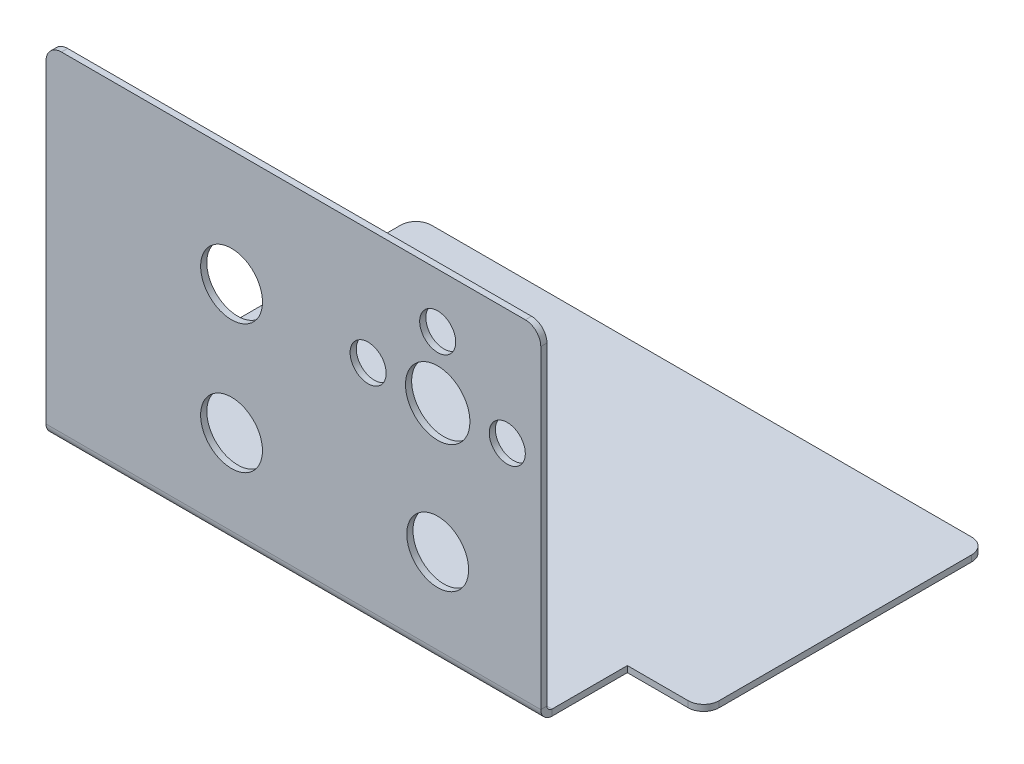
ISO-10303-21;
HEADER;
FILE_DESCRIPTION(('STEP AP214'),'2;1');
FILE_NAME('part.step','',(''),(''),'','','');
FILE_SCHEMA(('AUTOMOTIVE_DESIGN { 1 0 10303 214 1 1 1 1 }'));
ENDSEC;
DATA;
#1=APPLICATION_CONTEXT('core data for automotive mechanical design processes');
#2=APPLICATION_PROTOCOL_DEFINITION('international standard','automotive_design',2000,#1);
#3=PRODUCT_CONTEXT('',#1,'mechanical');
#4=PRODUCT('Part','Part','',(#3));
#5=PRODUCT_RELATED_PRODUCT_CATEGORY('part','',(#4));
#6=PRODUCT_DEFINITION_FORMATION('','',#4);
#7=PRODUCT_DEFINITION_CONTEXT('part definition',#1,'design');
#8=PRODUCT_DEFINITION('design','',#6,#7);
#9=PRODUCT_DEFINITION_SHAPE('','',#8);
#10=(LENGTH_UNIT() NAMED_UNIT(*) SI_UNIT(.MILLI.,.METRE.));
#11=(NAMED_UNIT(*) PLANE_ANGLE_UNIT() SI_UNIT($,.RADIAN.));
#12=(NAMED_UNIT(*) SI_UNIT($,.STERADIAN.) SOLID_ANGLE_UNIT());
#13=UNCERTAINTY_MEASURE_WITH_UNIT(LENGTH_MEASURE(1.E-05),#10,'distance_accuracy_value','');
#14=(GEOMETRIC_REPRESENTATION_CONTEXT(3) GLOBAL_UNCERTAINTY_ASSIGNED_CONTEXT((#13)) GLOBAL_UNIT_ASSIGNED_CONTEXT((#10,
#11,#12)) REPRESENTATION_CONTEXT('',''));
#15=CARTESIAN_POINT('',(0.,0.,0.));
#16=DIRECTION('',(0.,0.,1.));
#17=DIRECTION('',(1.,0.,0.));
#18=AXIS2_PLACEMENT_3D('',#15,#16,#17);
#19=CARTESIAN_POINT('',(0.,0.,1.2));
#20=DIRECTION('',(1.,0.,0.));
#21=DIRECTION('',(0.,0.,1.));
#22=AXIS2_PLACEMENT_3D('',#19,#20,#21);
#23=PLANE('',#22);
#24=DIRECTION('',(0.,1.,0.));
#25=VECTOR('',#24,1.);
#26=CARTESIAN_POINT('',(0.,0.,1.2));
#27=LINE('',#26,#25);
#28=CARTESIAN_POINT('',(0.,0.999999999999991,1.19999999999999));
#29=VERTEX_POINT('',#28);
#30=CARTESIAN_POINT('',(0.,62.,1.2));
#31=VERTEX_POINT('',#30);
#32=EDGE_CURVE('E231',#29,#31,#27,.T.);
#33=ORIENTED_EDGE('',*,*,#32,.F.);
#34=DIRECTION('',(0.,0.,1.));
#35=VECTOR('',#34,1.);
#36=CARTESIAN_POINT('',(0.,0.999999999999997,0.));
#37=LINE('',#36,#35);
#38=CARTESIAN_POINT('',(0.,0.999999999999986,0.));
#39=VERTEX_POINT('',#38);
#40=EDGE_CURVE('E196',#39,#29,#37,.T.);
#41=ORIENTED_EDGE('',*,*,#40,.F.);
#42=DIRECTION('',(0.,1.,0.));
#43=VECTOR('',#42,1.);
#44=CARTESIAN_POINT('',(0.,0.,0.));
#45=LINE('',#44,#43);
#46=CARTESIAN_POINT('',(0.,62.,0.));
#47=VERTEX_POINT('',#46);
#48=EDGE_CURVE('E228',#39,#47,#45,.T.);
#49=ORIENTED_EDGE('',*,*,#48,.T.);
#50=DIRECTION('',(0.,0.,-1.));
#51=VECTOR('',#50,1.);
#52=CARTESIAN_POINT('',(0.,62.,1.2));
#53=LINE('',#52,#51);
#54=EDGE_CURVE('E265',#31,#47,#53,.T.);
#55=ORIENTED_EDGE('',*,*,#54,.F.);
#56=EDGE_LOOP('',(#33,#41,#49,#55));
#57=FACE_BOUND('',#56,.T.);
#58=ADVANCED_FACE('F45',(#57),#23,.T.);
#59=CARTESIAN_POINT('',(0.,0.,1.2));
#60=DIRECTION('',(0.,0.,-1.));
#61=DIRECTION('',(1.,0.,0.));
#62=AXIS2_PLACEMENT_3D('',#59,#60,#61);
#63=PLANE('',#62);
#64=CARTESIAN_POINT('',(-60.,42.5,1.2));
#65=DIRECTION('',(0.,0.,1.));
#66=DIRECTION('',(1.,0.,0.));
#67=AXIS2_PLACEMENT_3D('',#64,#65,#66);
#68=CIRCLE('',#67,6.);
#69=CARTESIAN_POINT('',(-54.,42.5,1.2));
#70=VERTEX_POINT('',#69);
#71=EDGE_CURVE('E317',#70,#70,#68,.T.);
#72=ORIENTED_EDGE('',*,*,#71,.F.);
#73=EDGE_LOOP('',(#72));
#74=FACE_BOUND('',#73,.T.);
#75=CARTESIAN_POINT('',(-60.,17.5,1.2));
#76=DIRECTION('',(0.,0.,1.));
#77=DIRECTION('',(1.,0.,0.));
#78=AXIS2_PLACEMENT_3D('',#75,#76,#77);
#79=CIRCLE('',#78,6.00000000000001);
#80=CARTESIAN_POINT('',(-54.,17.5,1.2));
#81=VERTEX_POINT('',#80);
#82=EDGE_CURVE('E329',#81,#81,#79,.T.);
#83=ORIENTED_EDGE('',*,*,#82,.F.);
#84=EDGE_LOOP('',(#83));
#85=FACE_BOUND('',#84,.T.);
#86=CARTESIAN_POINT('',(-20.,17.5,1.2));
#87=DIRECTION('',(0.,0.,1.));
#88=DIRECTION('',(1.,0.,0.));
#89=AXIS2_PLACEMENT_3D('',#86,#87,#88);
#90=CIRCLE('',#89,6.);
#91=CARTESIAN_POINT('',(-14.,17.5,1.2));
#92=VERTEX_POINT('',#91);
#93=EDGE_CURVE('E323',#92,#92,#90,.T.);
#94=ORIENTED_EDGE('',*,*,#93,.F.);
#95=EDGE_LOOP('',(#94));
#96=FACE_BOUND('',#95,.T.);
#97=CARTESIAN_POINT('',(-20.,42.5,1.2));
#98=DIRECTION('',(0.,0.,1.));
#99=DIRECTION('',(1.,0.,0.));
#100=AXIS2_PLACEMENT_3D('',#97,#98,#99);
#101=CIRCLE('',#100,6.25);
#102=CARTESIAN_POINT('',(-13.75,42.5,1.2));
#103=VERTEX_POINT('',#102);
#104=EDGE_CURVE('E312',#103,#103,#101,.T.);
#105=ORIENTED_EDGE('',*,*,#104,.F.);
#106=EDGE_LOOP('',(#105));
#107=FACE_BOUND('',#106,.T.);
#108=CARTESIAN_POINT('',(-33.5,42.5,1.2));
#109=DIRECTION('',(0.,0.,1.));
#110=DIRECTION('',(1.,0.,0.));
#111=AXIS2_PLACEMENT_3D('',#108,#109,#110);
#112=CIRCLE('',#111,3.5);
#113=CARTESIAN_POINT('',(-30.,42.5,1.2));
#114=VERTEX_POINT('',#113);
#115=EDGE_CURVE('E225',#114,#114,#112,.T.);
#116=ORIENTED_EDGE('',*,*,#115,.F.);
#117=EDGE_LOOP('',(#116));
#118=FACE_BOUND('',#117,.T.);
#119=CARTESIAN_POINT('',(-6.5,42.5,1.2));
#120=DIRECTION('',(0.,0.,1.));
#121=DIRECTION('',(1.,0.,0.));
#122=AXIS2_PLACEMENT_3D('',#119,#120,#121);
#123=CIRCLE('',#122,3.50000000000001);
#124=CARTESIAN_POINT('',(-2.99999999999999,42.5,1.2));
#125=VERTEX_POINT('',#124);
#126=EDGE_CURVE('E219',#125,#125,#123,.T.);
#127=ORIENTED_EDGE('',*,*,#126,.F.);
#128=EDGE_LOOP('',(#127));
#129=FACE_BOUND('',#128,.T.);
#130=CARTESIAN_POINT('',(-20.,54.5,1.2));
#131=DIRECTION('',(0.,0.,1.));
#132=DIRECTION('',(1.,0.,0.));
#133=AXIS2_PLACEMENT_3D('',#130,#131,#132);
#134=CIRCLE('',#133,3.5);
#135=CARTESIAN_POINT('',(-16.5,54.5,1.2));
#136=VERTEX_POINT('',#135);
#137=EDGE_CURVE('E213',#136,#136,#134,.T.);
#138=ORIENTED_EDGE('',*,*,#137,.F.);
#139=EDGE_LOOP('',(#138));
#140=FACE_BOUND('',#139,.T.);
#141=DIRECTION('',(0.,-1.,0.));
#142=VECTOR('',#141,1.);
#143=CARTESIAN_POINT('',(-96.,0.,1.2));
#144=LINE('',#143,#142);
#145=CARTESIAN_POINT('',(-96.,62.,1.2));
#146=VERTEX_POINT('',#145);
#147=CARTESIAN_POINT('',(-96.,0.999999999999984,1.2));
#148=VERTEX_POINT('',#147);
#149=EDGE_CURVE('E238',#146,#148,#144,.T.);
#150=ORIENTED_EDGE('',*,*,#149,.T.);
#151=DIRECTION('',(1.,0.,0.));
#152=VECTOR('',#151,1.);
#153=CARTESIAN_POINT('',(0.,0.999999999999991,1.19999999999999));
#154=LINE('',#153,#152);
#155=EDGE_CURVE('E189',#29,#148,#154,.F.);
#156=ORIENTED_EDGE('',*,*,#155,.F.);
#157=ORIENTED_EDGE('',*,*,#32,.T.);
#158=CARTESIAN_POINT('',(-3.,62.,1.2));
#159=DIRECTION('',(0.,0.,1.));
#160=DIRECTION('',(1.,0.,0.));
#161=AXIS2_PLACEMENT_3D('',#158,#159,#160);
#162=CIRCLE('',#161,3.);
#163=CARTESIAN_POINT('',(-3.,65.,1.2));
#164=VERTEX_POINT('',#163);
#165=EDGE_CURVE('E260',#164,#31,#162,.F.);
#166=ORIENTED_EDGE('',*,*,#165,.F.);
#167=DIRECTION('',(-1.,0.,0.));
#168=VECTOR('',#167,1.);
#169=CARTESIAN_POINT('',(0.,65.,1.2));
#170=LINE('',#169,#168);
#171=CARTESIAN_POINT('',(-93.,65.,1.2));
#172=VERTEX_POINT('',#171);
#173=EDGE_CURVE('E234',#164,#172,#170,.T.);
#174=ORIENTED_EDGE('',*,*,#173,.T.);
#175=CARTESIAN_POINT('',(-93.,62.,1.2));
#176=DIRECTION('',(0.,0.,1.));
#177=DIRECTION('',(1.,0.,0.));
#178=AXIS2_PLACEMENT_3D('',#175,#176,#177);
#179=CIRCLE('',#178,3.);
#180=EDGE_CURVE('E262',#146,#172,#179,.F.);
#181=ORIENTED_EDGE('',*,*,#180,.F.);
#182=EDGE_LOOP('',(#150,#156,#157,#166,#174,#181));
#183=FACE_BOUND('',#182,.T.);
#184=ADVANCED_FACE('F341',(#74,#85,#96,#107,#118,#129,#140,#183),#63,.F.);
#185=CARTESIAN_POINT('',(0.,0.,0.));
#186=DIRECTION('',(0.,0.,-1.));
#187=DIRECTION('',(1.,0.,0.));
#188=AXIS2_PLACEMENT_3D('',#185,#186,#187);
#189=PLANE('',#188);
#190=CARTESIAN_POINT('',(-60.,42.5,0.));
#191=DIRECTION('',(0.,0.,1.));
#192=DIRECTION('',(1.,0.,0.));
#193=AXIS2_PLACEMENT_3D('',#190,#191,#192);
#194=CIRCLE('',#193,6.);
#195=CARTESIAN_POINT('',(-54.,42.5,0.));
#196=VERTEX_POINT('',#195);
#197=EDGE_CURVE('E332',#196,#196,#194,.T.);
#198=ORIENTED_EDGE('',*,*,#197,.T.);
#199=EDGE_LOOP('',(#198));
#200=FACE_BOUND('',#199,.T.);
#201=CARTESIAN_POINT('',(-60.,17.5,0.));
#202=DIRECTION('',(0.,0.,1.));
#203=DIRECTION('',(1.,0.,0.));
#204=AXIS2_PLACEMENT_3D('',#201,#202,#203);
#205=CIRCLE('',#204,6.00000000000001);
#206=CARTESIAN_POINT('',(-54.,17.5,0.));
#207=VERTEX_POINT('',#206);
#208=EDGE_CURVE('E326',#207,#207,#205,.T.);
#209=ORIENTED_EDGE('',*,*,#208,.T.);
#210=EDGE_LOOP('',(#209));
#211=FACE_BOUND('',#210,.T.);
#212=CARTESIAN_POINT('',(-20.,17.5,0.));
#213=DIRECTION('',(0.,0.,1.));
#214=DIRECTION('',(1.,0.,0.));
#215=AXIS2_PLACEMENT_3D('',#212,#213,#214);
#216=CIRCLE('',#215,6.);
#217=CARTESIAN_POINT('',(-14.,17.5,0.));
#218=VERTEX_POINT('',#217);
#219=EDGE_CURVE('E320',#218,#218,#216,.T.);
#220=ORIENTED_EDGE('',*,*,#219,.T.);
#221=EDGE_LOOP('',(#220));
#222=FACE_BOUND('',#221,.T.);
#223=CARTESIAN_POINT('',(-20.,42.5,0.));
#224=DIRECTION('',(0.,0.,1.));
#225=DIRECTION('',(1.,0.,0.));
#226=AXIS2_PLACEMENT_3D('',#223,#224,#225);
#227=CIRCLE('',#226,6.25);
#228=CARTESIAN_POINT('',(-13.75,42.5,0.));
#229=VERTEX_POINT('',#228);
#230=EDGE_CURVE('E314',#229,#229,#227,.T.);
#231=ORIENTED_EDGE('',*,*,#230,.T.);
#232=EDGE_LOOP('',(#231));
#233=FACE_BOUND('',#232,.T.);
#234=CARTESIAN_POINT('',(-20.,54.5,0.));
#235=DIRECTION('',(0.,0.,1.));
#236=DIRECTION('',(1.,0.,0.));
#237=AXIS2_PLACEMENT_3D('',#234,#235,#236);
#238=CIRCLE('',#237,3.5);
#239=CARTESIAN_POINT('',(-16.5,54.5,0.));
#240=VERTEX_POINT('',#239);
#241=EDGE_CURVE('E210',#240,#240,#238,.T.);
#242=ORIENTED_EDGE('',*,*,#241,.T.);
#243=EDGE_LOOP('',(#242));
#244=FACE_BOUND('',#243,.T.);
#245=CARTESIAN_POINT('',(-6.5,42.5,0.));
#246=DIRECTION('',(0.,0.,1.));
#247=DIRECTION('',(1.,0.,0.));
#248=AXIS2_PLACEMENT_3D('',#245,#246,#247);
#249=CIRCLE('',#248,3.50000000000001);
#250=CARTESIAN_POINT('',(-2.99999999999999,42.5,0.));
#251=VERTEX_POINT('',#250);
#252=EDGE_CURVE('E216',#251,#251,#249,.T.);
#253=ORIENTED_EDGE('',*,*,#252,.T.);
#254=EDGE_LOOP('',(#253));
#255=FACE_BOUND('',#254,.T.);
#256=CARTESIAN_POINT('',(-33.5,42.5,0.));
#257=DIRECTION('',(0.,0.,1.));
#258=DIRECTION('',(1.,0.,0.));
#259=AXIS2_PLACEMENT_3D('',#256,#257,#258);
#260=CIRCLE('',#259,3.5);
#261=CARTESIAN_POINT('',(-30.,42.5,0.));
#262=VERTEX_POINT('',#261);
#263=EDGE_CURVE('E222',#262,#262,#260,.T.);
#264=ORIENTED_EDGE('',*,*,#263,.T.);
#265=EDGE_LOOP('',(#264));
#266=FACE_BOUND('',#265,.T.);
#267=DIRECTION('',(-1.,0.,0.));
#268=VECTOR('',#267,1.);
#269=CARTESIAN_POINT('',(0.,65.,0.));
#270=LINE('',#269,#268);
#271=CARTESIAN_POINT('',(-3.,65.,0.));
#272=VERTEX_POINT('',#271);
#273=CARTESIAN_POINT('',(-93.,65.,0.));
#274=VERTEX_POINT('',#273);
#275=EDGE_CURVE('E244',#272,#274,#270,.T.);
#276=ORIENTED_EDGE('',*,*,#275,.F.);
#277=CARTESIAN_POINT('',(-3.,62.,0.));
#278=DIRECTION('',(0.,0.,1.));
#279=DIRECTION('',(1.,0.,0.));
#280=AXIS2_PLACEMENT_3D('',#277,#278,#279);
#281=CIRCLE('',#280,3.);
#282=EDGE_CURVE('E252',#47,#272,#281,.T.);
#283=ORIENTED_EDGE('',*,*,#282,.F.);
#284=ORIENTED_EDGE('',*,*,#48,.F.);
#285=DIRECTION('',(1.,0.,0.));
#286=VECTOR('',#285,1.);
#287=CARTESIAN_POINT('',(0.,0.999999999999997,0.));
#288=LINE('',#287,#286);
#289=CARTESIAN_POINT('',(-96.,0.999999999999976,0.));
#290=VERTEX_POINT('',#289);
#291=EDGE_CURVE('E201',#39,#290,#288,.F.);
#292=ORIENTED_EDGE('',*,*,#291,.T.);
#293=DIRECTION('',(0.,-1.,0.));
#294=VECTOR('',#293,1.);
#295=CARTESIAN_POINT('',(-96.,0.,0.));
#296=LINE('',#295,#294);
#297=CARTESIAN_POINT('',(-96.,62.,0.));
#298=VERTEX_POINT('',#297);
#299=EDGE_CURVE('E235',#298,#290,#296,.T.);
#300=ORIENTED_EDGE('',*,*,#299,.F.);
#301=CARTESIAN_POINT('',(-93.,62.,0.));
#302=DIRECTION('',(0.,0.,1.));
#303=DIRECTION('',(1.,0.,0.));
#304=AXIS2_PLACEMENT_3D('',#301,#302,#303);
#305=CIRCLE('',#304,3.);
#306=EDGE_CURVE('E255',#274,#298,#305,.T.);
#307=ORIENTED_EDGE('',*,*,#306,.F.);
#308=EDGE_LOOP('',(#276,#283,#284,#292,#300,#307));
#309=FACE_BOUND('',#308,.T.);
#310=ADVANCED_FACE('F344',(#200,#211,#222,#233,#244,#255,#266,#309),#189,.T.);
#311=CARTESIAN_POINT('',(-96.,0.,1.2));
#312=DIRECTION('',(-1.,0.,0.));
#313=DIRECTION('',(0.,0.,-1.));
#314=AXIS2_PLACEMENT_3D('',#311,#312,#313);
#315=PLANE('',#314);
#316=ORIENTED_EDGE('',*,*,#299,.T.);
#317=DIRECTION('',(0.,0.,1.));
#318=VECTOR('',#317,1.);
#319=CARTESIAN_POINT('',(-96.,0.999999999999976,0.));
#320=LINE('',#319,#318);
#321=EDGE_CURVE('E207',#290,#148,#320,.T.);
#322=ORIENTED_EDGE('',*,*,#321,.T.);
#323=ORIENTED_EDGE('',*,*,#149,.F.);
#324=DIRECTION('',(0.,0.,-1.));
#325=VECTOR('',#324,1.);
#326=CARTESIAN_POINT('',(-96.,62.,1.2));
#327=LINE('',#326,#325);
#328=EDGE_CURVE('E258',#298,#146,#327,.F.);
#329=ORIENTED_EDGE('',*,*,#328,.F.);
#330=EDGE_LOOP('',(#316,#322,#323,#329));
#331=FACE_BOUND('',#330,.T.);
#332=ADVANCED_FACE('F362',(#331),#315,.T.);
#333=CARTESIAN_POINT('',(0.,65.,1.2));
#334=DIRECTION('',(0.,1.,0.));
#335=DIRECTION('',(-1.,0.,0.));
#336=AXIS2_PLACEMENT_3D('',#333,#334,#335);
#337=PLANE('',#336);
#338=ORIENTED_EDGE('',*,*,#173,.F.);
#339=DIRECTION('',(0.,0.,-1.));
#340=VECTOR('',#339,1.);
#341=CARTESIAN_POINT('',(-3.,65.,1.2));
#342=LINE('',#341,#340);
#343=EDGE_CURVE('E241',#272,#164,#342,.F.);
#344=ORIENTED_EDGE('',*,*,#343,.F.);
#345=ORIENTED_EDGE('',*,*,#275,.T.);
#346=DIRECTION('',(0.,0.,-1.));
#347=VECTOR('',#346,1.);
#348=CARTESIAN_POINT('',(-93.,65.,1.2));
#349=LINE('',#348,#347);
#350=EDGE_CURVE('E250',#172,#274,#349,.T.);
#351=ORIENTED_EDGE('',*,*,#350,.F.);
#352=EDGE_LOOP('',(#338,#344,#345,#351));
#353=FACE_BOUND('',#352,.T.);
#354=ADVANCED_FACE('F383',(#353),#337,.T.);
#355=CARTESIAN_POINT('',(-33.5,42.5,1.2));
#356=DIRECTION('',(0.,0.,-1.));
#357=DIRECTION('',(1.,0.,0.));
#358=AXIS2_PLACEMENT_3D('',#355,#356,#357);
#359=CYLINDRICAL_SURFACE('',#358,3.5);
#360=ORIENTED_EDGE('',*,*,#115,.T.);
#361=EDGE_LOOP('',(#360));
#362=FACE_BOUND('',#361,.T.);
#363=ORIENTED_EDGE('',*,*,#263,.F.);
#364=EDGE_LOOP('',(#363));
#365=FACE_BOUND('',#364,.T.);
#366=ADVANCED_FACE('F460',(#362,#365),#359,.F.);
#367=CARTESIAN_POINT('',(-6.5,42.5,1.2));
#368=DIRECTION('',(0.,0.,-1.));
#369=DIRECTION('',(1.,0.,0.));
#370=AXIS2_PLACEMENT_3D('',#367,#368,#369);
#371=CYLINDRICAL_SURFACE('',#370,3.50000000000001);
#372=ORIENTED_EDGE('',*,*,#126,.T.);
#373=EDGE_LOOP('',(#372));
#374=FACE_BOUND('',#373,.T.);
#375=ORIENTED_EDGE('',*,*,#252,.F.);
#376=EDGE_LOOP('',(#375));
#377=FACE_BOUND('',#376,.T.);
#378=ADVANCED_FACE('F456',(#374,#377),#371,.F.);
#379=CARTESIAN_POINT('',(-20.,54.5,1.2));
#380=DIRECTION('',(0.,0.,-1.));
#381=DIRECTION('',(1.,0.,0.));
#382=AXIS2_PLACEMENT_3D('',#379,#380,#381);
#383=CYLINDRICAL_SURFACE('',#382,3.5);
#384=ORIENTED_EDGE('',*,*,#137,.T.);
#385=EDGE_LOOP('',(#384));
#386=FACE_BOUND('',#385,.T.);
#387=ORIENTED_EDGE('',*,*,#241,.F.);
#388=EDGE_LOOP('',(#387));
#389=FACE_BOUND('',#388,.T.);
#390=ADVANCED_FACE('F451',(#386,#389),#383,.F.);
#391=CARTESIAN_POINT('',(-96.,0.99999999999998,-1.));
#392=DIRECTION('',(-1.,0.,0.));
#393=DIRECTION('',(0.,-1.,0.));
#394=AXIS2_PLACEMENT_3D('',#391,#392,#393);
#395=PLANE('',#394);
#396=DIRECTION('',(0.,-1.,0.));
#397=VECTOR('',#396,1.);
#398=CARTESIAN_POINT('',(-96.,0.,-0.999999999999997));
#399=LINE('',#398,#397);
#400=CARTESIAN_POINT('',(-96.,0.,-0.999999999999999));
#401=VERTEX_POINT('',#400);
#402=CARTESIAN_POINT('',(-96.,-1.20000000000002,-0.999999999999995));
#403=VERTEX_POINT('',#402);
#404=EDGE_CURVE('E172',#401,#403,#399,.T.);
#405=ORIENTED_EDGE('',*,*,#404,.T.);
#406=CARTESIAN_POINT('',(-96.,0.99999999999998,-1.));
#407=DIRECTION('',(-1.,0.,0.));
#408=DIRECTION('',(0.,1.,0.));
#409=AXIS2_PLACEMENT_3D('',#406,#407,#408);
#410=CIRCLE('',#409,2.2);
#411=EDGE_CURVE('E192',#148,#403,#410,.F.);
#412=ORIENTED_EDGE('',*,*,#411,.F.);
#413=ORIENTED_EDGE('',*,*,#321,.F.);
#414=CARTESIAN_POINT('',(-96.,0.99999999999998,-1.));
#415=DIRECTION('',(-1.,0.,0.));
#416=DIRECTION('',(0.,1.,0.));
#417=AXIS2_PLACEMENT_3D('',#414,#415,#416);
#418=CIRCLE('',#417,0.999999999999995);
#419=EDGE_CURVE('E198',#290,#401,#418,.F.);
#420=ORIENTED_EDGE('',*,*,#419,.T.);
#421=EDGE_LOOP('',(#405,#412,#413,#420));
#422=FACE_BOUND('',#421,.T.);
#423=ADVANCED_FACE('F391',(#422),#395,.T.);
#424=CARTESIAN_POINT('',(0.,1.,-1.));
#425=DIRECTION('',(-1.,0.,0.));
#426=DIRECTION('',(0.,-1.,0.));
#427=AXIS2_PLACEMENT_3D('',#424,#425,#426);
#428=PLANE('',#427);
#429=CARTESIAN_POINT('',(0.,1.,-1.));
#430=DIRECTION('',(-1.,0.,0.));
#431=DIRECTION('',(0.,1.,0.));
#432=AXIS2_PLACEMENT_3D('',#429,#430,#431);
#433=CIRCLE('',#432,0.999999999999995);
#434=CARTESIAN_POINT('',(0.,0.,-0.999999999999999));
#435=VERTEX_POINT('',#434);
#436=EDGE_CURVE('E204',#435,#39,#433,.T.);
#437=ORIENTED_EDGE('',*,*,#436,.T.);
#438=ORIENTED_EDGE('',*,*,#40,.T.);
#439=CARTESIAN_POINT('',(0.,1.,-1.));
#440=DIRECTION('',(-1.,0.,0.));
#441=DIRECTION('',(0.,1.,0.));
#442=AXIS2_PLACEMENT_3D('',#439,#440,#441);
#443=CIRCLE('',#442,2.2);
#444=CARTESIAN_POINT('',(0.,-1.20000000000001,-0.999999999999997));
#445=VERTEX_POINT('',#444);
#446=EDGE_CURVE('E193',#445,#29,#443,.T.);
#447=ORIENTED_EDGE('',*,*,#446,.F.);
#448=DIRECTION('',(0.,-1.,0.));
#449=VECTOR('',#448,1.);
#450=CARTESIAN_POINT('',(0.,0.,-1.));
#451=LINE('',#450,#449);
#452=EDGE_CURVE('E303',#435,#445,#451,.T.);
#453=ORIENTED_EDGE('',*,*,#452,.F.);
#454=EDGE_LOOP('',(#437,#438,#447,#453));
#455=FACE_BOUND('',#454,.T.);
#456=ADVANCED_FACE('F370',(#455),#428,.F.);
#457=CARTESIAN_POINT('',(0.,1.,-1.));
#458=DIRECTION('',(1.,0.,0.));
#459=DIRECTION('',(0.,-1.,0.));
#460=AXIS2_PLACEMENT_3D('',#457,#458,#459);
#461=CYLINDRICAL_SURFACE('',#460,2.2);
#462=ORIENTED_EDGE('',*,*,#155,.T.);
#463=ORIENTED_EDGE('',*,*,#411,.T.);
#464=DIRECTION('',(-1.,0.,0.));
#465=VECTOR('',#464,1.);
#466=CARTESIAN_POINT('',(0.,-1.2,-0.999999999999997));
#467=LINE('',#466,#465);
#468=EDGE_CURVE('E185',#445,#403,#467,.T.);
#469=ORIENTED_EDGE('',*,*,#468,.F.);
#470=ORIENTED_EDGE('',*,*,#446,.T.);
#471=EDGE_LOOP('',(#462,#463,#469,#470));
#472=FACE_BOUND('',#471,.T.);
#473=ADVANCED_FACE('F367',(#472),#461,.T.);
#474=CARTESIAN_POINT('',(0.,1.,-1.));
#475=DIRECTION('',(1.,0.,0.));
#476=DIRECTION('',(0.,-1.,0.));
#477=AXIS2_PLACEMENT_3D('',#474,#475,#476);
#478=CYLINDRICAL_SURFACE('',#477,0.999999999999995);
#479=ORIENTED_EDGE('',*,*,#291,.F.);
#480=ORIENTED_EDGE('',*,*,#436,.F.);
#481=DIRECTION('',(1.,0.,0.));
#482=VECTOR('',#481,1.);
#483=CARTESIAN_POINT('',(-96.,0.,-0.999999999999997));
#484=LINE('',#483,#482);
#485=EDGE_CURVE('E177',#401,#435,#484,.T.);
#486=ORIENTED_EDGE('',*,*,#485,.F.);
#487=ORIENTED_EDGE('',*,*,#419,.F.);
#488=EDGE_LOOP('',(#479,#480,#486,#487));
#489=FACE_BOUND('',#488,.T.);
#490=ADVANCED_FACE('F390',(#489),#478,.F.);
#491=CARTESIAN_POINT('',(-96.,-1.20000000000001,0.));
#492=DIRECTION('',(1.,0.,0.));
#493=DIRECTION('',(0.,1.,0.));
#494=AXIS2_PLACEMENT_3D('',#491,#492,#493);
#495=PLANE('',#494);
#496=DIRECTION('',(0.,0.,1.));
#497=VECTOR('',#496,1.);
#498=CARTESIAN_POINT('',(-96.,-1.20000000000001,0.));
#499=LINE('',#498,#497);
#500=CARTESIAN_POINT('',(-96.,-1.20000000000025,-67.6));
#501=VERTEX_POINT('',#500);
#502=EDGE_CURVE('E183',#501,#403,#499,.T.);
#503=ORIENTED_EDGE('',*,*,#502,.T.);
#504=ORIENTED_EDGE('',*,*,#404,.F.);
#505=DIRECTION('',(0.,0.,1.));
#506=VECTOR('',#505,1.);
#507=CARTESIAN_POINT('',(-96.,0.,0.));
#508=LINE('',#507,#506);
#509=CARTESIAN_POINT('',(-96.,-2.4778074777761E-13,-67.6));
#510=VERTEX_POINT('',#509);
#511=EDGE_CURVE('E180',#510,#401,#508,.T.);
#512=ORIENTED_EDGE('',*,*,#511,.F.);
#513=DIRECTION('',(0.,1.,0.));
#514=VECTOR('',#513,1.);
#515=CARTESIAN_POINT('',(-96.,-1.20000000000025,-67.6));
#516=LINE('',#515,#514);
#517=EDGE_CURVE('E11',#501,#510,#516,.T.);
#518=ORIENTED_EDGE('',*,*,#517,.F.);
#519=EDGE_LOOP('',(#503,#504,#512,#518));
#520=FACE_BOUND('',#519,.T.);
#521=ADVANCED_FACE('F393',(#520),#495,.F.);
#522=CARTESIAN_POINT('',(0.,-1.20000000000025,-70.6));
#523=DIRECTION('',(-1.,0.,0.));
#524=DIRECTION('',(0.,-1.,0.));
#525=AXIS2_PLACEMENT_3D('',#522,#523,#524);
#526=PLANE('',#525);
#527=DIRECTION('',(0.,0.,-1.));
#528=VECTOR('',#527,1.);
#529=CARTESIAN_POINT('',(0.,-2.46498582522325E-13,-70.6));
#530=LINE('',#529,#528);
#531=CARTESIAN_POINT('',(0.,0.,-15.6));
#532=VERTEX_POINT('',#531);
#533=EDGE_CURVE('E169',#435,#532,#530,.T.);
#534=ORIENTED_EDGE('',*,*,#533,.F.);
#535=ORIENTED_EDGE('',*,*,#452,.T.);
#536=DIRECTION('',(0.,0.,-1.));
#537=VECTOR('',#536,1.);
#538=CARTESIAN_POINT('',(0.,-1.20000000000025,-70.6));
#539=LINE('',#538,#537);
#540=CARTESIAN_POINT('',(0.,-1.20000000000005,-15.6));
#541=VERTEX_POINT('',#540);
#542=EDGE_CURVE('E171',#445,#541,#539,.T.);
#543=ORIENTED_EDGE('',*,*,#542,.T.);
#544=DIRECTION('',(0.,-1.,0.));
#545=VECTOR('',#544,1.);
#546=CARTESIAN_POINT('',(0.,0.,-15.6));
#547=LINE('',#546,#545);
#548=EDGE_CURVE('E156',#532,#541,#547,.T.);
#549=ORIENTED_EDGE('',*,*,#548,.F.);
#550=EDGE_LOOP('',(#534,#535,#543,#549));
#551=FACE_BOUND('',#550,.T.);
#552=ADVANCED_FACE('F167',(#551),#526,.F.);
#553=CARTESIAN_POINT('',(0.,-1.2,0.));
#554=DIRECTION('',(0.,1.,0.));
#555=DIRECTION('',(0.,0.,-1.));
#556=AXIS2_PLACEMENT_3D('',#553,#554,#555);
#557=PLANE('',#556);
#558=DIRECTION('',(1.,0.,0.));
#559=VECTOR('',#558,1.);
#560=CARTESIAN_POINT('',(0.,-1.20000000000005,-15.6));
#561=LINE('',#560,#559);
#562=CARTESIAN_POINT('',(11.8,-1.20000000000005,-15.6));
#563=VERTEX_POINT('',#562);
#564=EDGE_CURVE('E310',#541,#563,#561,.T.);
#565=ORIENTED_EDGE('',*,*,#564,.F.);
#566=ORIENTED_EDGE('',*,*,#542,.F.);
#567=ORIENTED_EDGE('',*,*,#468,.T.);
#568=ORIENTED_EDGE('',*,*,#502,.F.);
#569=CARTESIAN_POINT('',(-93.,-1.20000000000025,-67.6));
#570=DIRECTION('',(0.,-1.,0.));
#571=DIRECTION('',(0.,0.,-1.));
#572=AXIS2_PLACEMENT_3D('',#569,#570,#571);
#573=CIRCLE('',#572,3.);
#574=CARTESIAN_POINT('',(-93.,-1.20000000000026,-70.6));
#575=VERTEX_POINT('',#574);
#576=EDGE_CURVE('E269',#575,#501,#573,.F.);
#577=ORIENTED_EDGE('',*,*,#576,.F.);
#578=DIRECTION('',(-1.,0.,0.));
#579=VECTOR('',#578,1.);
#580=CARTESIAN_POINT('',(-96.,-1.20000000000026,-70.6));
#581=LINE('',#580,#579);
#582=CARTESIAN_POINT('',(11.8,-1.20000000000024,-70.6));
#583=VERTEX_POINT('',#582);
#584=EDGE_CURVE('E206',#583,#575,#581,.T.);
#585=ORIENTED_EDGE('',*,*,#584,.F.);
#586=CARTESIAN_POINT('',(11.8,-1.20000000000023,-67.6));
#587=DIRECTION('',(0.,-1.,0.));
#588=DIRECTION('',(0.,0.,-1.));
#589=AXIS2_PLACEMENT_3D('',#586,#587,#588);
#590=CIRCLE('',#589,3.);
#591=CARTESIAN_POINT('',(14.8,-1.20000000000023,-67.6));
#592=VERTEX_POINT('',#591);
#593=EDGE_CURVE('E271',#592,#583,#590,.F.);
#594=ORIENTED_EDGE('',*,*,#593,.F.);
#595=DIRECTION('',(0.,0.,-1.));
#596=VECTOR('',#595,1.);
#597=CARTESIAN_POINT('',(14.8,-1.20000000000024,-70.6));
#598=LINE('',#597,#596);
#599=CARTESIAN_POINT('',(14.8,-1.20000000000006,-18.6));
#600=VERTEX_POINT('',#599);
#601=EDGE_CURVE('E164',#600,#592,#598,.T.);
#602=ORIENTED_EDGE('',*,*,#601,.F.);
#603=CARTESIAN_POINT('',(11.8,-1.20000000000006,-18.6));
#604=DIRECTION('',(0.,-1.,0.));
#605=DIRECTION('',(0.,0.,-1.));
#606=AXIS2_PLACEMENT_3D('',#603,#604,#605);
#607=CIRCLE('',#606,3.);
#608=EDGE_CURVE('E273',#563,#600,#607,.F.);
#609=ORIENTED_EDGE('',*,*,#608,.F.);
#610=EDGE_LOOP('',(#565,#566,#567,#568,#577,#585,#594,#602,#609));
#611=FACE_BOUND('',#610,.T.);
#612=ADVANCED_FACE('F294',(#611),#557,.F.);
#613=CARTESIAN_POINT('',(0.,0.,0.));
#614=DIRECTION('',(0.,1.,0.));
#615=DIRECTION('',(0.,0.,-1.));
#616=AXIS2_PLACEMENT_3D('',#613,#614,#615);
#617=PLANE('',#616);
#618=DIRECTION('',(0.,0.,-1.));
#619=VECTOR('',#618,1.);
#620=CARTESIAN_POINT('',(14.8,-2.4459601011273E-13,-70.6));
#621=LINE('',#620,#619);
#622=CARTESIAN_POINT('',(14.8,0.,-18.6));
#623=VERTEX_POINT('',#622);
#624=CARTESIAN_POINT('',(14.8,-2.34128530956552E-13,-67.6));
#625=VERTEX_POINT('',#624);
#626=EDGE_CURVE('E163',#623,#625,#621,.T.);
#627=ORIENTED_EDGE('',*,*,#626,.T.);
#628=CARTESIAN_POINT('',(11.8,-2.34579055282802E-13,-67.6));
#629=DIRECTION('',(0.,-1.,0.));
#630=DIRECTION('',(0.,0.,-1.));
#631=AXIS2_PLACEMENT_3D('',#628,#629,#630);
#632=CIRCLE('',#631,3.);
#633=CARTESIAN_POINT('',(11.8,-2.45053499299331E-13,-70.6));
#634=VERTEX_POINT('',#633);
#635=EDGE_CURVE('E282',#634,#625,#632,.T.);
#636=ORIENTED_EDGE('',*,*,#635,.F.);
#637=DIRECTION('',(-1.,0.,0.));
#638=VECTOR('',#637,1.);
#639=CARTESIAN_POINT('',(-96.,-2.5825519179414E-13,-70.6));
#640=LINE('',#639,#638);
#641=CARTESIAN_POINT('',(-93.,-2.57887797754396E-13,-70.6));
#642=VERTEX_POINT('',#641);
#643=EDGE_CURVE('E179',#634,#642,#640,.T.);
#644=ORIENTED_EDGE('',*,*,#643,.T.);
#645=CARTESIAN_POINT('',(-93.,-2.47414935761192E-13,-67.6));
#646=DIRECTION('',(0.,-1.,0.));
#647=DIRECTION('',(0.,0.,-1.));
#648=AXIS2_PLACEMENT_3D('',#645,#646,#647);
#649=CIRCLE('',#648,3.);
#650=EDGE_CURVE('E280',#510,#642,#649,.T.);
#651=ORIENTED_EDGE('',*,*,#650,.F.);
#652=ORIENTED_EDGE('',*,*,#511,.T.);
#653=ORIENTED_EDGE('',*,*,#485,.T.);
#654=ORIENTED_EDGE('',*,*,#533,.T.);
#655=DIRECTION('',(1.,0.,0.));
#656=VECTOR('',#655,1.);
#657=CARTESIAN_POINT('',(0.,0.,-15.6));
#658=LINE('',#657,#656);
#659=CARTESIAN_POINT('',(11.8,0.,-15.6));
#660=VERTEX_POINT('',#659);
#661=EDGE_CURVE('E152',#532,#660,#658,.T.);
#662=ORIENTED_EDGE('',*,*,#661,.T.);
#663=CARTESIAN_POINT('',(11.8,0.,-18.6));
#664=DIRECTION('',(0.,-1.,0.));
#665=DIRECTION('',(0.,0.,-1.));
#666=AXIS2_PLACEMENT_3D('',#663,#664,#665);
#667=CIRCLE('',#666,3.);
#668=EDGE_CURVE('E284',#623,#660,#667,.T.);
#669=ORIENTED_EDGE('',*,*,#668,.F.);
#670=EDGE_LOOP('',(#627,#636,#644,#651,#652,#653,#654,#662,#669));
#671=FACE_BOUND('',#670,.T.);
#672=ADVANCED_FACE('F175',(#671),#617,.T.);
#673=CARTESIAN_POINT('',(-96.,-1.20000000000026,-70.6));
#674=DIRECTION('',(0.,0.,1.));
#675=DIRECTION('',(0.,1.,0.));
#676=AXIS2_PLACEMENT_3D('',#673,#674,#675);
#677=PLANE('',#676);
#678=ORIENTED_EDGE('',*,*,#584,.T.);
#679=DIRECTION('',(0.,1.,0.));
#680=VECTOR('',#679,1.);
#681=CARTESIAN_POINT('',(-93.,-1.20000000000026,-70.6));
#682=LINE('',#681,#680);
#683=EDGE_CURVE('E60',#642,#575,#682,.F.);
#684=ORIENTED_EDGE('',*,*,#683,.F.);
#685=ORIENTED_EDGE('',*,*,#643,.F.);
#686=DIRECTION('',(0.,-1.,0.));
#687=VECTOR('',#686,1.);
#688=CARTESIAN_POINT('',(11.8,-2.44963404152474E-13,-70.6));
#689=LINE('',#688,#687);
#690=EDGE_CURVE('E53',#583,#634,#689,.F.);
#691=ORIENTED_EDGE('',*,*,#690,.F.);
#692=EDGE_LOOP('',(#678,#684,#685,#691));
#693=FACE_BOUND('',#692,.T.);
#694=ADVANCED_FACE('F290',(#693),#677,.F.);
#695=CARTESIAN_POINT('',(14.8,-2.4459601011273E-13,-70.6));
#696=DIRECTION('',(1.,0.,0.));
#697=DIRECTION('',(0.,1.,0.));
#698=AXIS2_PLACEMENT_3D('',#695,#696,#697);
#699=PLANE('',#698);
#700=ORIENTED_EDGE('',*,*,#601,.T.);
#701=DIRECTION('',(0.,-1.,0.));
#702=VECTOR('',#701,1.);
#703=CARTESIAN_POINT('',(14.8,-1.20000000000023,-67.6));
#704=LINE('',#703,#702);
#705=EDGE_CURVE('E276',#625,#592,#704,.T.);
#706=ORIENTED_EDGE('',*,*,#705,.F.);
#707=ORIENTED_EDGE('',*,*,#626,.F.);
#708=DIRECTION('',(0.,-1.,0.));
#709=VECTOR('',#708,1.);
#710=CARTESIAN_POINT('',(14.8,0.,-18.6));
#711=LINE('',#710,#709);
#712=EDGE_CURVE('E278',#600,#623,#711,.F.);
#713=ORIENTED_EDGE('',*,*,#712,.F.);
#714=EDGE_LOOP('',(#700,#706,#707,#713));
#715=FACE_BOUND('',#714,.T.);
#716=ADVANCED_FACE('F399',(#715),#699,.T.);
#717=CARTESIAN_POINT('',(0.,0.,-15.6));
#718=DIRECTION('',(0.,0.,1.));
#719=DIRECTION('',(0.,1.,0.));
#720=AXIS2_PLACEMENT_3D('',#717,#718,#719);
#721=PLANE('',#720);
#722=ORIENTED_EDGE('',*,*,#661,.F.);
#723=ORIENTED_EDGE('',*,*,#548,.T.);
#724=ORIENTED_EDGE('',*,*,#564,.T.);
#725=DIRECTION('',(0.,-1.,0.));
#726=VECTOR('',#725,1.);
#727=CARTESIAN_POINT('',(11.8,0.,-15.6));
#728=LINE('',#727,#726);
#729=EDGE_CURVE('E158',#660,#563,#728,.T.);
#730=ORIENTED_EDGE('',*,*,#729,.F.);
#731=EDGE_LOOP('',(#722,#723,#724,#730));
#732=FACE_BOUND('',#731,.T.);
#733=ADVANCED_FACE('F154',(#732),#721,.T.);
#734=CARTESIAN_POINT('',(-20.,42.5,1.2));
#735=DIRECTION('',(0.,0.,-1.));
#736=DIRECTION('',(1.,0.,0.));
#737=AXIS2_PLACEMENT_3D('',#734,#735,#736);
#738=CYLINDRICAL_SURFACE('',#737,6.25);
#739=ORIENTED_EDGE('',*,*,#104,.T.);
#740=EDGE_LOOP('',(#739));
#741=FACE_BOUND('',#740,.T.);
#742=ORIENTED_EDGE('',*,*,#230,.F.);
#743=EDGE_LOOP('',(#742));
#744=FACE_BOUND('',#743,.T.);
#745=ADVANCED_FACE('F418',(#741,#744),#738,.F.);
#746=CARTESIAN_POINT('',(-93.,62.,1.2));
#747=DIRECTION('',(0.,0.,-1.));
#748=DIRECTION('',(1.,0.,0.));
#749=AXIS2_PLACEMENT_3D('',#746,#747,#748);
#750=CYLINDRICAL_SURFACE('',#749,3.);
#751=ORIENTED_EDGE('',*,*,#180,.T.);
#752=ORIENTED_EDGE('',*,*,#350,.T.);
#753=ORIENTED_EDGE('',*,*,#306,.T.);
#754=ORIENTED_EDGE('',*,*,#328,.T.);
#755=EDGE_LOOP('',(#751,#752,#753,#754));
#756=FACE_BOUND('',#755,.T.);
#757=ADVANCED_FACE('F386',(#756),#750,.T.);
#758=CARTESIAN_POINT('',(-3.,62.,1.2));
#759=DIRECTION('',(0.,0.,-1.));
#760=DIRECTION('',(1.,0.,0.));
#761=AXIS2_PLACEMENT_3D('',#758,#759,#760);
#762=CYLINDRICAL_SURFACE('',#761,3.);
#763=ORIENTED_EDGE('',*,*,#165,.T.);
#764=ORIENTED_EDGE('',*,*,#54,.T.);
#765=ORIENTED_EDGE('',*,*,#282,.T.);
#766=ORIENTED_EDGE('',*,*,#343,.T.);
#767=EDGE_LOOP('',(#763,#764,#765,#766));
#768=FACE_BOUND('',#767,.T.);
#769=ADVANCED_FACE('F380',(#768),#762,.T.);
#770=CARTESIAN_POINT('',(11.8,0.,-18.6));
#771=DIRECTION('',(0.,-1.,0.));
#772=DIRECTION('',(0.,0.,1.));
#773=AXIS2_PLACEMENT_3D('',#770,#771,#772);
#774=CYLINDRICAL_SURFACE('',#773,3.);
#775=ORIENTED_EDGE('',*,*,#668,.T.);
#776=ORIENTED_EDGE('',*,*,#729,.T.);
#777=ORIENTED_EDGE('',*,*,#608,.T.);
#778=ORIENTED_EDGE('',*,*,#712,.T.);
#779=EDGE_LOOP('',(#775,#776,#777,#778));
#780=FACE_BOUND('',#779,.T.);
#781=ADVANCED_FACE('F402',(#780),#774,.T.);
#782=CARTESIAN_POINT('',(11.8,-2.34488960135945E-13,-67.6));
#783=DIRECTION('',(0.,1.,0.));
#784=DIRECTION('',(0.,0.,-1.));
#785=AXIS2_PLACEMENT_3D('',#782,#783,#784);
#786=CYLINDRICAL_SURFACE('',#785,3.);
#787=ORIENTED_EDGE('',*,*,#635,.T.);
#788=ORIENTED_EDGE('',*,*,#705,.T.);
#789=ORIENTED_EDGE('',*,*,#593,.T.);
#790=ORIENTED_EDGE('',*,*,#690,.T.);
#791=EDGE_LOOP('',(#787,#788,#789,#790));
#792=FACE_BOUND('',#791,.T.);
#793=ADVANCED_FACE('F396',(#792),#786,.T.);
#794=CARTESIAN_POINT('',(-93.,-1.20000000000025,-67.6));
#795=DIRECTION('',(0.,1.,0.));
#796=DIRECTION('',(0.,0.,-1.));
#797=AXIS2_PLACEMENT_3D('',#794,#795,#796);
#798=CYLINDRICAL_SURFACE('',#797,3.);
#799=ORIENTED_EDGE('',*,*,#576,.T.);
#800=ORIENTED_EDGE('',*,*,#517,.T.);
#801=ORIENTED_EDGE('',*,*,#650,.T.);
#802=ORIENTED_EDGE('',*,*,#683,.T.);
#803=EDGE_LOOP('',(#799,#800,#801,#802));
#804=FACE_BOUND('',#803,.T.);
#805=ADVANCED_FACE('F47',(#804),#798,.T.);
#806=CARTESIAN_POINT('',(-20.,17.5,1.2));
#807=DIRECTION('',(0.,0.,-1.));
#808=DIRECTION('',(1.,0.,0.));
#809=AXIS2_PLACEMENT_3D('',#806,#807,#808);
#810=CYLINDRICAL_SURFACE('',#809,6.);
#811=ORIENTED_EDGE('',*,*,#93,.T.);
#812=EDGE_LOOP('',(#811));
#813=FACE_BOUND('',#812,.T.);
#814=ORIENTED_EDGE('',*,*,#219,.F.);
#815=EDGE_LOOP('',(#814));
#816=FACE_BOUND('',#815,.T.);
#817=ADVANCED_FACE('F431',(#813,#816),#810,.F.);
#818=CARTESIAN_POINT('',(-60.,17.5,1.2));
#819=DIRECTION('',(0.,0.,-1.));
#820=DIRECTION('',(1.,0.,0.));
#821=AXIS2_PLACEMENT_3D('',#818,#819,#820);
#822=CYLINDRICAL_SURFACE('',#821,6.00000000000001);
#823=ORIENTED_EDGE('',*,*,#82,.T.);
#824=EDGE_LOOP('',(#823));
#825=FACE_BOUND('',#824,.T.);
#826=ORIENTED_EDGE('',*,*,#208,.F.);
#827=EDGE_LOOP('',(#826));
#828=FACE_BOUND('',#827,.T.);
#829=ADVANCED_FACE('F576',(#825,#828),#822,.F.);
#830=CARTESIAN_POINT('',(-60.,42.5,1.2));
#831=DIRECTION('',(0.,0.,-1.));
#832=DIRECTION('',(1.,0.,0.));
#833=AXIS2_PLACEMENT_3D('',#830,#831,#832);
#834=CYLINDRICAL_SURFACE('',#833,6.);
#835=ORIENTED_EDGE('',*,*,#71,.T.);
#836=EDGE_LOOP('',(#835));
#837=FACE_BOUND('',#836,.T.);
#838=ORIENTED_EDGE('',*,*,#197,.F.);
#839=EDGE_LOOP('',(#838));
#840=FACE_BOUND('',#839,.T.);
#841=ADVANCED_FACE('F338',(#837,#840),#834,.F.);
#842=CLOSED_SHELL('',(#58,#184,#310,#332,#354,#366,#378,#390,#423,#456,#473,#490,#521,#552,#612,
#672,#694,#716,#733,#745,#757,#769,#781,#793,#805,#817,#829,#841));
#843=MANIFOLD_SOLID_BREP('B2',#842);
#844=ADVANCED_BREP_SHAPE_REPRESENTATION('',(#18,#843),#14);
#845=SHAPE_DEFINITION_REPRESENTATION(#9,#844);
ENDSEC;
END-ISO-10303-21;
